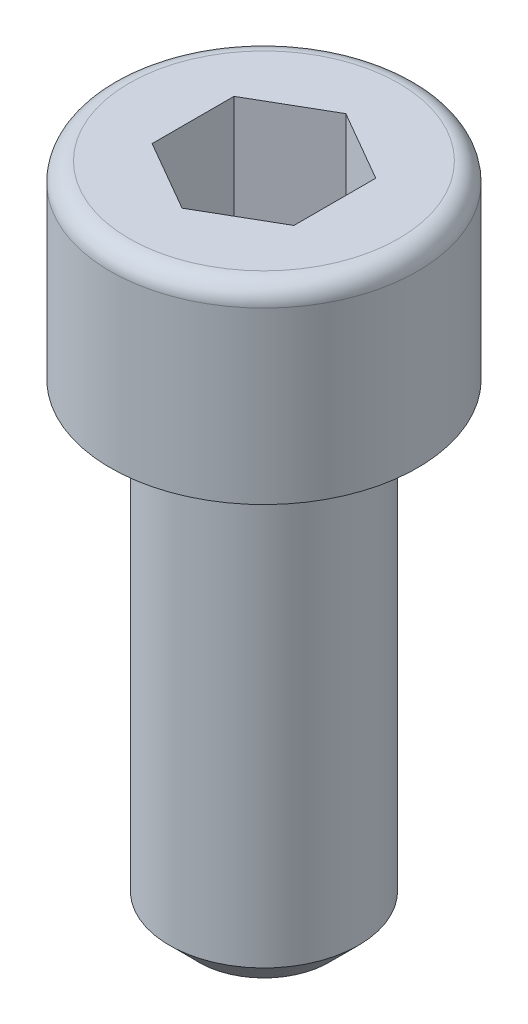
ISO-10303-21;
HEADER;
FILE_DESCRIPTION(('STEP AP214'),'2;1');
FILE_NAME('part.step','',(''),(''),'','','');
FILE_SCHEMA(('AUTOMOTIVE_DESIGN { 1 0 10303 214 1 1 1 1 }'));
ENDSEC;
DATA;
#1=APPLICATION_CONTEXT('core data for automotive mechanical design processes');
#2=APPLICATION_PROTOCOL_DEFINITION('international standard','automotive_design',2000,#1);
#3=PRODUCT_CONTEXT('',#1,'mechanical');
#4=PRODUCT('Part','Part','',(#3));
#5=PRODUCT_RELATED_PRODUCT_CATEGORY('part','',(#4));
#6=PRODUCT_DEFINITION_FORMATION('','',#4);
#7=PRODUCT_DEFINITION_CONTEXT('part definition',#1,'design');
#8=PRODUCT_DEFINITION('design','',#6,#7);
#9=PRODUCT_DEFINITION_SHAPE('','',#8);
#10=(LENGTH_UNIT() NAMED_UNIT(*) SI_UNIT(.MILLI.,.METRE.));
#11=(NAMED_UNIT(*) PLANE_ANGLE_UNIT() SI_UNIT($,.RADIAN.));
#12=(NAMED_UNIT(*) SI_UNIT($,.STERADIAN.) SOLID_ANGLE_UNIT());
#13=UNCERTAINTY_MEASURE_WITH_UNIT(LENGTH_MEASURE(1.E-05),#10,'distance_accuracy_value','');
#14=(GEOMETRIC_REPRESENTATION_CONTEXT(3) GLOBAL_UNCERTAINTY_ASSIGNED_CONTEXT((#13)) GLOBAL_UNIT_ASSIGNED_CONTEXT((#10,
#11,#12)) REPRESENTATION_CONTEXT('',''));
#15=CARTESIAN_POINT('',(0.,0.,0.));
#16=DIRECTION('',(0.,0.,1.));
#17=DIRECTION('',(1.,0.,0.));
#18=AXIS2_PLACEMENT_3D('',#15,#16,#17);
#19=CARTESIAN_POINT('',(2.75000000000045,-27.9999999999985,0.));
#20=DIRECTION('',(0.,-1.,0.));
#21=DIRECTION('',(1.,0.,0.));
#22=AXIS2_PLACEMENT_3D('',#19,#20,#21);
#23=PLANE('',#22);
#24=CARTESIAN_POINT('',(2.28983498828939E-13,-27.9999999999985,-1.21430643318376E-13));
#25=DIRECTION('',(0.,1.,0.));
#26=DIRECTION('',(-1.,0.,0.));
#27=AXIS2_PLACEMENT_3D('',#24,#25,#26);
#28=CIRCLE('',#27,2.75);
#29=CARTESIAN_POINT('',(-2.74999999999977,-27.9999999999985,-1.21430643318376E-13));
#30=VERTEX_POINT('',#29);
#31=EDGE_CURVE('E11',#30,#30,#28,.T.);
#32=ORIENTED_EDGE('',*,*,#31,.F.);
#33=EDGE_LOOP('',(#32));
#34=FACE_BOUND('',#33,.T.);
#35=ADVANCED_FACE('F348',(#34),#23,.T.);
#36=CARTESIAN_POINT('',(2.28983498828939E-13,-27.9999999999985,-1.21430643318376E-13));
#37=DIRECTION('',(0.,1.,0.));
#38=DIRECTION('',(-1.,0.,0.));
#39=AXIS2_PLACEMENT_3D('',#36,#37,#38);
#40=CONICAL_SURFACE('',#39,2.75,0.785398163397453);
#41=CARTESIAN_POINT('',(2.22044604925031E-13,-26.7499999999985,0.));
#42=DIRECTION('',(0.,1.,0.));
#43=DIRECTION('',(-1.,0.,0.));
#44=AXIS2_PLACEMENT_3D('',#41,#42,#43);
#45=CIRCLE('',#44,4.);
#46=CARTESIAN_POINT('',(-3.99999999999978,-26.7499999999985,0.));
#47=VERTEX_POINT('',#46);
#48=EDGE_CURVE('E355',#47,#47,#45,.T.);
#49=ORIENTED_EDGE('',*,*,#48,.F.);
#50=EDGE_LOOP('',(#49));
#51=FACE_BOUND('',#50,.T.);
#52=ORIENTED_EDGE('',*,*,#31,.T.);
#53=EDGE_LOOP('',(#52));
#54=FACE_BOUND('',#53,.T.);
#55=ADVANCED_FACE('F471',(#51,#54),#40,.T.);
#56=CARTESIAN_POINT('',(2.15105711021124E-13,65.1172922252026,0.));
#57=DIRECTION('',(0.,1.,0.));
#58=DIRECTION('',(-1.,0.,0.));
#59=AXIS2_PLACEMENT_3D('',#56,#57,#58);
#60=CYLINDRICAL_SURFACE('',#59,3.99999999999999);
#61=ORIENTED_EDGE('',*,*,#48,.T.);
#62=EDGE_LOOP('',(#61));
#63=FACE_BOUND('',#62,.T.);
#64=CARTESIAN_POINT('',(0.,-7.99999999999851,0.));
#65=DIRECTION('',(0.,1.,0.));
#66=DIRECTION('',(-1.,0.,0.));
#67=AXIS2_PLACEMENT_3D('',#64,#65,#66);
#68=CIRCLE('',#67,3.99999999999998);
#69=CARTESIAN_POINT('',(-3.99999999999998,-7.99999999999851,0.));
#70=VERTEX_POINT('',#69);
#71=EDGE_CURVE('E463',#70,#70,#68,.T.);
#72=ORIENTED_EDGE('',*,*,#71,.F.);
#73=EDGE_LOOP('',(#72));
#74=FACE_BOUND('',#73,.T.);
#75=ADVANCED_FACE('F468',(#63,#74),#60,.T.);
#76=CARTESIAN_POINT('',(3.99999999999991,-7.99999999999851,-1.42247325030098E-13));
#77=DIRECTION('',(0.,1.,0.));
#78=DIRECTION('',(-1.,0.,0.));
#79=AXIS2_PLACEMENT_3D('',#76,#77,#78);
#80=PLANE('',#79);
#81=CARTESIAN_POINT('',(0.,-7.99999999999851,0.));
#82=DIRECTION('',(0.,1.,0.));
#83=DIRECTION('',(-1.,0.,0.));
#84=AXIS2_PLACEMENT_3D('',#81,#82,#83);
#85=CIRCLE('',#84,6.49999999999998);
#86=CARTESIAN_POINT('',(-6.49999999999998,-7.99999999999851,0.));
#87=VERTEX_POINT('',#86);
#88=EDGE_CURVE('E460',#87,#87,#85,.T.);
#89=ORIENTED_EDGE('',*,*,#88,.F.);
#90=EDGE_LOOP('',(#89));
#91=FACE_BOUND('',#90,.T.);
#92=ORIENTED_EDGE('',*,*,#71,.T.);
#93=EDGE_LOOP('',(#92));
#94=FACE_BOUND('',#93,.T.);
#95=ADVANCED_FACE('F485',(#91,#94),#80,.F.);
#96=CARTESIAN_POINT('',(2.15105711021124E-13,65.1172922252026,0.));
#97=DIRECTION('',(0.,1.,0.));
#98=DIRECTION('',(-1.,0.,0.));
#99=AXIS2_PLACEMENT_3D('',#96,#97,#98);
#100=CYLINDRICAL_SURFACE('',#99,6.49999999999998);
#101=CARTESIAN_POINT('',(0.,-0.799999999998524,0.));
#102=DIRECTION('',(0.,1.,0.));
#103=DIRECTION('',(-1.,0.,0.));
#104=AXIS2_PLACEMENT_3D('',#101,#102,#103);
#105=CIRCLE('',#104,6.49999999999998);
#106=CARTESIAN_POINT('',(-6.49999999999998,-0.799999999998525,0.));
#107=VERTEX_POINT('',#106);
#108=EDGE_CURVE('E457',#107,#107,#105,.T.);
#109=ORIENTED_EDGE('',*,*,#108,.F.);
#110=EDGE_LOOP('',(#109));
#111=FACE_BOUND('',#110,.T.);
#112=ORIENTED_EDGE('',*,*,#88,.T.);
#113=EDGE_LOOP('',(#112));
#114=FACE_BOUND('',#113,.T.);
#115=ADVANCED_FACE('F490',(#111,#114),#100,.T.);
#116=CARTESIAN_POINT('',(0.,-0.799999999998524,0.));
#117=DIRECTION('',(0.,1.,0.));
#118=DIRECTION('',(-1.,0.,0.));
#119=AXIS2_PLACEMENT_3D('',#116,#117,#118);
#120=TOROIDAL_SURFACE('',#119,5.69999999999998,0.8);
#121=CARTESIAN_POINT('',(0.,1.49880108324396E-12,0.));
#122=DIRECTION('',(0.,1.,0.));
#123=DIRECTION('',(-1.,0.,0.));
#124=AXIS2_PLACEMENT_3D('',#121,#122,#123);
#125=CIRCLE('',#124,5.69999999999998);
#126=CARTESIAN_POINT('',(-5.69999999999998,1.49811086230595E-12,0.));
#127=VERTEX_POINT('',#126);
#128=EDGE_CURVE('E448',#127,#127,#125,.T.);
#129=ORIENTED_EDGE('',*,*,#128,.F.);
#130=EDGE_LOOP('',(#129));
#131=FACE_BOUND('',#130,.T.);
#132=ORIENTED_EDGE('',*,*,#108,.T.);
#133=EDGE_LOOP('',(#132));
#134=FACE_BOUND('',#133,.T.);
#135=ADVANCED_FACE('F496',(#131,#134),#120,.T.);
#136=CARTESIAN_POINT('',(5.7,1.49880108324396E-12,0.));
#137=DIRECTION('',(0.,-1.,0.));
#138=DIRECTION('',(1.,0.,0.));
#139=AXIS2_PLACEMENT_3D('',#136,#137,#138);
#140=PLANE('',#139);
#141=DIRECTION('',(0.,0.,1.));
#142=VECTOR('',#141,1.);
#143=CARTESIAN_POINT('',(-3.,1.49880108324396E-12,-1.73205080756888));
#144=LINE('',#143,#142);
#145=CARTESIAN_POINT('',(-3.,1.49880108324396E-12,-1.73205080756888));
#146=VERTEX_POINT('',#145);
#147=CARTESIAN_POINT('',(-3.,1.49880108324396E-12,1.73205080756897));
#148=VERTEX_POINT('',#147);
#149=EDGE_CURVE('E425',#146,#148,#144,.T.);
#150=ORIENTED_EDGE('',*,*,#149,.F.);
#151=DIRECTION('',(-0.866025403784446,0.,0.5));
#152=VECTOR('',#151,1.);
#153=CARTESIAN_POINT('',(0.,1.49880108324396E-12,-3.46410161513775));
#154=LINE('',#153,#152);
#155=CARTESIAN_POINT('',(0.,1.49880108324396E-12,-3.46410161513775));
#156=VERTEX_POINT('',#155);
#157=EDGE_CURVE('E362',#156,#146,#154,.T.);
#158=ORIENTED_EDGE('',*,*,#157,.F.);
#159=DIRECTION('',(0.866025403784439,0.,0.5));
#160=VECTOR('',#159,1.);
#161=CARTESIAN_POINT('',(0.,1.49880108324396E-12,-3.46410161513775));
#162=LINE('',#161,#160);
#163=CARTESIAN_POINT('',(3.,1.49880108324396E-12,-1.732050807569));
#164=VERTEX_POINT('',#163);
#165=EDGE_CURVE('E595',#156,#164,#162,.T.);
#166=ORIENTED_EDGE('',*,*,#165,.T.);
#167=DIRECTION('',(0.,0.,1.));
#168=VECTOR('',#167,1.);
#169=CARTESIAN_POINT('',(3.,1.49880108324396E-12,-1.732050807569));
#170=LINE('',#169,#168);
#171=CARTESIAN_POINT('',(3.,1.49880108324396E-12,1.73205080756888));
#172=VERTEX_POINT('',#171);
#173=EDGE_CURVE('E592',#164,#172,#170,.T.);
#174=ORIENTED_EDGE('',*,*,#173,.T.);
#175=DIRECTION('',(-0.866025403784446,0.,0.5));
#176=VECTOR('',#175,1.);
#177=CARTESIAN_POINT('',(3.,1.49880108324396E-12,1.73205080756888));
#178=LINE('',#177,#176);
#179=CARTESIAN_POINT('',(0.,0.,3.46410161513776));
#180=VERTEX_POINT('',#179);
#181=EDGE_CURVE('E589',#172,#180,#178,.T.);
#182=ORIENTED_EDGE('',*,*,#181,.T.);
#183=DIRECTION('',(0.866025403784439,0.,0.5));
#184=VECTOR('',#183,1.);
#185=CARTESIAN_POINT('',(-3.,1.49880108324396E-12,1.73205080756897));
#186=LINE('',#185,#184);
#187=EDGE_CURVE('E587',#148,#180,#186,.T.);
#188=ORIENTED_EDGE('',*,*,#187,.F.);
#189=EDGE_LOOP('',(#150,#158,#166,#174,#182,#188));
#190=FACE_BOUND('',#189,.T.);
#191=ORIENTED_EDGE('',*,*,#128,.T.);
#192=EDGE_LOOP('',(#191));
#193=FACE_BOUND('',#192,.T.);
#194=ADVANCED_FACE('F502',(#190,#193),#140,.F.);
#195=CARTESIAN_POINT('',(1.31838984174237E-13,-5.75999999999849,-3.46410161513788));
#196=DIRECTION('',(-0.5,0.,-0.866025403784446));
#197=DIRECTION('',(-0.866025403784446,0.,0.5));
#198=AXIS2_PLACEMENT_3D('',#195,#196,#197);
#199=PLANE('',#198);
#200=ORIENTED_EDGE('',*,*,#157,.T.);
#201=DIRECTION('',(0.,1.,0.));
#202=VECTOR('',#201,1.);
#203=CARTESIAN_POINT('',(-3.,-5.75999999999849,-1.73205080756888));
#204=LINE('',#203,#202);
#205=CARTESIAN_POINT('',(-3.,-5.75999999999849,-1.73205080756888));
#206=VERTEX_POINT('',#205);
#207=EDGE_CURVE('E430',#206,#146,#204,.T.);
#208=ORIENTED_EDGE('',*,*,#207,.F.);
#209=DIRECTION('',(-0.866025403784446,0.,0.5));
#210=VECTOR('',#209,1.);
#211=CARTESIAN_POINT('',(1.31838984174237E-13,-5.75999999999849,-3.46410161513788));
#212=LINE('',#211,#210);
#213=CARTESIAN_POINT('',(1.31838984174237E-13,-5.75999999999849,-3.46410161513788));
#214=VERTEX_POINT('',#213);
#215=EDGE_CURVE('E419',#214,#206,#212,.T.);
#216=ORIENTED_EDGE('',*,*,#215,.F.);
#217=DIRECTION('',(0.,1.,0.));
#218=VECTOR('',#217,1.);
#219=CARTESIAN_POINT('',(1.31838984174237E-13,-5.75999999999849,-3.46410161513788));
#220=LINE('',#219,#218);
#221=EDGE_CURVE('E446',#214,#156,#220,.T.);
#222=ORIENTED_EDGE('',*,*,#221,.T.);
#223=EDGE_LOOP('',(#200,#208,#216,#222));
#224=FACE_BOUND('',#223,.T.);
#225=ADVANCED_FACE('F508',(#224),#199,.F.);
#226=CARTESIAN_POINT('',(1.31838984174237E-13,-5.75999999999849,-3.46410161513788));
#227=DIRECTION('',(-0.5,0.,0.866025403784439));
#228=DIRECTION('',(0.866025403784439,0.,0.5));
#229=AXIS2_PLACEMENT_3D('',#226,#227,#228);
#230=PLANE('',#229);
#231=ORIENTED_EDGE('',*,*,#165,.F.);
#232=ORIENTED_EDGE('',*,*,#221,.F.);
#233=DIRECTION('',(0.866025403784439,0.,0.5));
#234=VECTOR('',#233,1.);
#235=CARTESIAN_POINT('',(1.31838984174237E-13,-5.75999999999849,-3.46410161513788));
#236=LINE('',#235,#234);
#237=CARTESIAN_POINT('',(3.,-5.75999999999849,-1.732050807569));
#238=VERTEX_POINT('',#237);
#239=EDGE_CURVE('E443',#214,#238,#236,.T.);
#240=ORIENTED_EDGE('',*,*,#239,.T.);
#241=DIRECTION('',(0.,1.,0.));
#242=VECTOR('',#241,1.);
#243=CARTESIAN_POINT('',(3.,-5.75999999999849,-1.732050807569));
#244=LINE('',#243,#242);
#245=EDGE_CURVE('E449',#238,#164,#244,.T.);
#246=ORIENTED_EDGE('',*,*,#245,.T.);
#247=EDGE_LOOP('',(#231,#232,#240,#246));
#248=FACE_BOUND('',#247,.T.);
#249=ADVANCED_FACE('F514',(#248),#230,.T.);
#250=CARTESIAN_POINT('',(3.,-5.75999999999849,-1.732050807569));
#251=DIRECTION('',(-1.,0.,0.));
#252=DIRECTION('',(0.,-1.,0.));
#253=AXIS2_PLACEMENT_3D('',#250,#251,#252);
#254=PLANE('',#253);
#255=ORIENTED_EDGE('',*,*,#173,.F.);
#256=ORIENTED_EDGE('',*,*,#245,.F.);
#257=DIRECTION('',(0.,0.,1.));
#258=VECTOR('',#257,1.);
#259=CARTESIAN_POINT('',(3.,-5.75999999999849,-1.732050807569));
#260=LINE('',#259,#258);
#261=CARTESIAN_POINT('',(3.00000000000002,-5.75999999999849,1.73205080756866));
#262=VERTEX_POINT('',#261);
#263=EDGE_CURVE('E437',#238,#262,#260,.T.);
#264=ORIENTED_EDGE('',*,*,#263,.T.);
#265=DIRECTION('',(0.,1.,0.));
#266=VECTOR('',#265,1.);
#267=CARTESIAN_POINT('',(3.00000000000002,-5.75999999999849,1.73205080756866));
#268=LINE('',#267,#266);
#269=EDGE_CURVE('E451',#262,#172,#268,.T.);
#270=ORIENTED_EDGE('',*,*,#269,.T.);
#271=EDGE_LOOP('',(#255,#256,#264,#270));
#272=FACE_BOUND('',#271,.T.);
#273=ADVANCED_FACE('F519',(#272),#254,.T.);
#274=CARTESIAN_POINT('',(3.00000000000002,-5.75999999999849,1.73205080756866));
#275=DIRECTION('',(-0.5,0.,-0.866025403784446));
#276=DIRECTION('',(-0.866025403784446,0.,0.5));
#277=AXIS2_PLACEMENT_3D('',#274,#275,#276);
#278=PLANE('',#277);
#279=ORIENTED_EDGE('',*,*,#181,.F.);
#280=ORIENTED_EDGE('',*,*,#269,.F.);
#281=DIRECTION('',(-0.866025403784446,0.,0.5));
#282=VECTOR('',#281,1.);
#283=CARTESIAN_POINT('',(3.00000000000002,-5.75999999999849,1.73205080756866));
#284=LINE('',#283,#282);
#285=CARTESIAN_POINT('',(-3.19189119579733E-13,-5.75999999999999,3.4641016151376));
#286=VERTEX_POINT('',#285);
#287=EDGE_CURVE('E434',#262,#286,#284,.T.);
#288=ORIENTED_EDGE('',*,*,#287,.T.);
#289=DIRECTION('',(0.,1.,0.));
#290=VECTOR('',#289,1.);
#291=CARTESIAN_POINT('',(-3.19189119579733E-13,-5.75999999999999,3.4641016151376));
#292=LINE('',#291,#290);
#293=EDGE_CURVE('E429',#286,#180,#292,.T.);
#294=ORIENTED_EDGE('',*,*,#293,.T.);
#295=EDGE_LOOP('',(#279,#280,#288,#294));
#296=FACE_BOUND('',#295,.T.);
#297=ADVANCED_FACE('F525',(#296),#278,.T.);
#298=CARTESIAN_POINT('',(-3.00000000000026,-5.75999999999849,1.73205080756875));
#299=DIRECTION('',(-0.5,0.,0.866025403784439));
#300=DIRECTION('',(0.866025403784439,0.,0.5));
#301=AXIS2_PLACEMENT_3D('',#298,#299,#300);
#302=PLANE('',#301);
#303=ORIENTED_EDGE('',*,*,#187,.T.);
#304=ORIENTED_EDGE('',*,*,#293,.F.);
#305=DIRECTION('',(0.866025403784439,0.,0.5));
#306=VECTOR('',#305,1.);
#307=CARTESIAN_POINT('',(-3.00000000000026,-5.75999999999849,1.73205080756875));
#308=LINE('',#307,#306);
#309=CARTESIAN_POINT('',(-3.00000000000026,-5.75999999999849,1.73205080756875));
#310=VERTEX_POINT('',#309);
#311=EDGE_CURVE('E370',#310,#286,#308,.T.);
#312=ORIENTED_EDGE('',*,*,#311,.F.);
#313=DIRECTION('',(0.,1.,0.));
#314=VECTOR('',#313,1.);
#315=CARTESIAN_POINT('',(-3.00000000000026,-5.75999999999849,1.73205080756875));
#316=LINE('',#315,#314);
#317=EDGE_CURVE('E422',#310,#148,#316,.T.);
#318=ORIENTED_EDGE('',*,*,#317,.T.);
#319=EDGE_LOOP('',(#303,#304,#312,#318));
#320=FACE_BOUND('',#319,.T.);
#321=ADVANCED_FACE('F433',(#320),#302,.F.);
#322=CARTESIAN_POINT('',(-3.,-5.75999999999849,-1.73205080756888));
#323=DIRECTION('',(-1.,0.,0.));
#324=DIRECTION('',(0.,-1.,0.));
#325=AXIS2_PLACEMENT_3D('',#322,#323,#324);
#326=PLANE('',#325);
#327=ORIENTED_EDGE('',*,*,#149,.T.);
#328=ORIENTED_EDGE('',*,*,#317,.F.);
#329=DIRECTION('',(0.,0.,1.));
#330=VECTOR('',#329,1.);
#331=CARTESIAN_POINT('',(-3.,-5.75999999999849,-1.73205080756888));
#332=LINE('',#331,#330);
#333=EDGE_CURVE('E412',#206,#310,#332,.T.);
#334=ORIENTED_EDGE('',*,*,#333,.F.);
#335=ORIENTED_EDGE('',*,*,#207,.T.);
#336=EDGE_LOOP('',(#327,#328,#334,#335));
#337=FACE_BOUND('',#336,.T.);
#338=ADVANCED_FACE('F423',(#337),#326,.F.);
#339=CARTESIAN_POINT('',(-3.,-5.75999999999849,-1.73205080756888));
#340=DIRECTION('',(0.10431923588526,0.977992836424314,0.180686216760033));
#341=DIRECTION('',(0.,-0.181677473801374,0.983358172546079));
#342=AXIS2_PLACEMENT_3D('',#339,#340,#341);
#343=PLANE('',#342);
#344=DIRECTION('',(-0.85161315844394,0.181677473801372,-0.491679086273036));
#345=VECTOR('',#344,1.);
#346=CARTESIAN_POINT('',(0.,-6.39999999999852,0.));
#347=LINE('',#346,#345);
#348=CARTESIAN_POINT('',(0.,-6.39999999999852,0.));
#349=VERTEX_POINT('',#348);
#350=EDGE_CURVE('E416',#349,#206,#347,.T.);
#351=ORIENTED_EDGE('',*,*,#350,.F.);
#352=DIRECTION('',(0.,0.181677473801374,-0.983358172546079));
#353=VECTOR('',#352,1.);
#354=CARTESIAN_POINT('',(0.,-6.39999999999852,0.));
#355=LINE('',#354,#353);
#356=EDGE_CURVE('E576',#349,#214,#355,.T.);
#357=ORIENTED_EDGE('',*,*,#356,.T.);
#358=ORIENTED_EDGE('',*,*,#215,.T.);
#359=EDGE_LOOP('',(#351,#357,#358));
#360=FACE_BOUND('',#359,.T.);
#361=ADVANCED_FACE('F540',(#360),#343,.T.);
#362=CARTESIAN_POINT('',(1.31838984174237E-13,-5.75999999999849,-3.46410161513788));
#363=DIRECTION('',(-0.10431923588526,0.977992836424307,0.180686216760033));
#364=DIRECTION('',(0.,-0.181677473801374,0.983358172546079));
#365=AXIS2_PLACEMENT_3D('',#362,#363,#364);
#366=PLANE('',#365);
#367=ORIENTED_EDGE('',*,*,#356,.F.);
#368=DIRECTION('',(0.851613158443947,0.181677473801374,-0.491679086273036));
#369=VECTOR('',#368,1.);
#370=CARTESIAN_POINT('',(0.,-6.39999999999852,0.));
#371=LINE('',#370,#369);
#372=EDGE_CURVE('E408',#349,#238,#371,.T.);
#373=ORIENTED_EDGE('',*,*,#372,.T.);
#374=ORIENTED_EDGE('',*,*,#239,.F.);
#375=EDGE_LOOP('',(#367,#373,#374));
#376=FACE_BOUND('',#375,.T.);
#377=ADVANCED_FACE('F546',(#376),#366,.T.);
#378=CARTESIAN_POINT('',(-3.00000000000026,-5.75999999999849,1.73205080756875));
#379=DIRECTION('',(0.208638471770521,0.977992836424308,0.));
#380=DIRECTION('',(-0.977992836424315,0.208638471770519,0.));
#381=AXIS2_PLACEMENT_3D('',#378,#379,#380);
#382=PLANE('',#381);
#383=DIRECTION('',(-0.85161315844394,0.181677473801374,0.491679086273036));
#384=VECTOR('',#383,1.);
#385=CARTESIAN_POINT('',(0.,-6.39999999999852,0.));
#386=LINE('',#385,#384);
#387=EDGE_CURVE('E402',#349,#310,#386,.T.);
#388=ORIENTED_EDGE('',*,*,#387,.F.);
#389=ORIENTED_EDGE('',*,*,#350,.T.);
#390=ORIENTED_EDGE('',*,*,#333,.T.);
#391=EDGE_LOOP('',(#388,#389,#390));
#392=FACE_BOUND('',#391,.T.);
#393=ADVANCED_FACE('F414',(#392),#382,.T.);
#394=CARTESIAN_POINT('',(3.,-5.75999999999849,-1.732050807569));
#395=DIRECTION('',(-0.208638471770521,0.977992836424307,0.));
#396=DIRECTION('',(-0.977992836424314,-0.208638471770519,0.));
#397=AXIS2_PLACEMENT_3D('',#394,#395,#396);
#398=PLANE('',#397);
#399=ORIENTED_EDGE('',*,*,#372,.F.);
#400=DIRECTION('',(0.851613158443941,0.181677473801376,0.491679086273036));
#401=VECTOR('',#400,1.);
#402=CARTESIAN_POINT('',(0.,-6.39999999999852,0.));
#403=LINE('',#402,#401);
#404=EDGE_CURVE('E409',#349,#262,#403,.T.);
#405=ORIENTED_EDGE('',*,*,#404,.T.);
#406=ORIENTED_EDGE('',*,*,#263,.F.);
#407=EDGE_LOOP('',(#399,#405,#406));
#408=FACE_BOUND('',#407,.T.);
#409=ADVANCED_FACE('F557',(#408),#398,.T.);
#410=CARTESIAN_POINT('',(-3.19189119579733E-13,-5.75999999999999,3.4641016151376));
#411=DIRECTION('',(0.10431923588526,0.977992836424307,-0.180686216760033));
#412=DIRECTION('',(0.,0.181677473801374,0.983358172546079));
#413=AXIS2_PLACEMENT_3D('',#410,#411,#412);
#414=PLANE('',#413);
#415=DIRECTION('',(0.,0.181677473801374,0.983358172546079));
#416=VECTOR('',#415,1.);
#417=CARTESIAN_POINT('',(0.,-6.39999999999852,0.));
#418=LINE('',#417,#416);
#419=EDGE_CURVE('E405',#349,#286,#418,.T.);
#420=ORIENTED_EDGE('',*,*,#419,.F.);
#421=ORIENTED_EDGE('',*,*,#387,.T.);
#422=ORIENTED_EDGE('',*,*,#311,.T.);
#423=EDGE_LOOP('',(#420,#421,#422));
#424=FACE_BOUND('',#423,.T.);
#425=ADVANCED_FACE('F404',(#424),#414,.T.);
#426=CARTESIAN_POINT('',(3.00000000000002,-5.75999999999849,1.73205080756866));
#427=DIRECTION('',(-0.10431923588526,0.9779928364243,-0.180686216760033));
#428=DIRECTION('',(0.,0.181677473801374,0.983358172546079));
#429=AXIS2_PLACEMENT_3D('',#426,#427,#428);
#430=PLANE('',#429);
#431=ORIENTED_EDGE('',*,*,#404,.F.);
#432=ORIENTED_EDGE('',*,*,#419,.T.);
#433=ORIENTED_EDGE('',*,*,#287,.F.);
#434=EDGE_LOOP('',(#431,#432,#433));
#435=FACE_BOUND('',#434,.T.);
#436=ADVANCED_FACE('F542',(#435),#430,.T.);
#437=CLOSED_SHELL('',(#35,#55,#75,#95,#115,#135,#194,#225,#249,#273,#297,#321,#338,#361,#377,
#393,#409,#425,#436));
#438=MANIFOLD_SOLID_BREP('B2',#437);
#439=ADVANCED_BREP_SHAPE_REPRESENTATION('',(#18,#438),#14);
#440=SHAPE_DEFINITION_REPRESENTATION(#9,#439);
ENDSEC;
END-ISO-10303-21;
